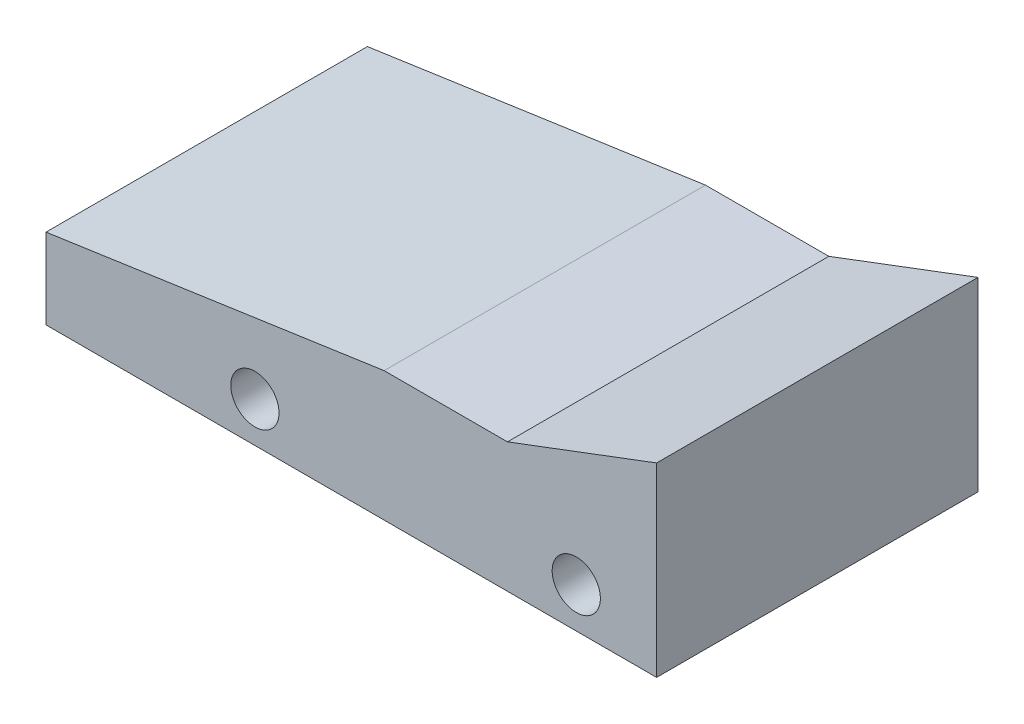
ISO-10303-21;
HEADER;
FILE_DESCRIPTION(('STEP AP214'),'2;1');
FILE_NAME('part.step','',(''),(''),'','','');
FILE_SCHEMA(('AUTOMOTIVE_DESIGN { 1 0 10303 214 1 1 1 1 }'));
ENDSEC;
DATA;
#1=APPLICATION_CONTEXT('core data for automotive mechanical design processes');
#2=APPLICATION_PROTOCOL_DEFINITION('international standard','automotive_design',2000,#1);
#3=PRODUCT_CONTEXT('',#1,'mechanical');
#4=PRODUCT('Part','Part','',(#3));
#5=PRODUCT_RELATED_PRODUCT_CATEGORY('part','',(#4));
#6=PRODUCT_DEFINITION_FORMATION('','',#4);
#7=PRODUCT_DEFINITION_CONTEXT('part definition',#1,'design');
#8=PRODUCT_DEFINITION('design','',#6,#7);
#9=PRODUCT_DEFINITION_SHAPE('','',#8);
#10=(LENGTH_UNIT() NAMED_UNIT(*) SI_UNIT(.MILLI.,.METRE.));
#11=(NAMED_UNIT(*) PLANE_ANGLE_UNIT() SI_UNIT($,.RADIAN.));
#12=(NAMED_UNIT(*) SI_UNIT($,.STERADIAN.) SOLID_ANGLE_UNIT());
#13=UNCERTAINTY_MEASURE_WITH_UNIT(LENGTH_MEASURE(1.E-05),#10,'distance_accuracy_value','');
#14=(GEOMETRIC_REPRESENTATION_CONTEXT(3) GLOBAL_UNCERTAINTY_ASSIGNED_CONTEXT((#13)) GLOBAL_UNIT_ASSIGNED_CONTEXT((#10,
#11,#12)) REPRESENTATION_CONTEXT('',''));
#15=CARTESIAN_POINT('',(0.,0.,0.));
#16=DIRECTION('',(0.,0.,1.));
#17=DIRECTION('',(1.,0.,0.));
#18=AXIS2_PLACEMENT_3D('',#15,#16,#17);
#19=CARTESIAN_POINT('',(0.,0.,508.));
#20=DIRECTION('',(0.,0.,1.));
#21=DIRECTION('',(1.,0.,0.));
#22=AXIS2_PLACEMENT_3D('',#19,#20,#21);
#23=PLANE('',#22);
#24=CARTESIAN_POINT('',(295.731148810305,49.8467537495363,508.));
#25=DIRECTION('',(0.,0.,1.));
#26=DIRECTION('',(1.,0.,0.));
#27=AXIS2_PLACEMENT_3D('',#24,#25,#26);
#28=CIRCLE('',#27,38.1);
#29=CARTESIAN_POINT('',(333.831148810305,49.8467537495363,508.));
#30=VERTEX_POINT('',#29);
#31=EDGE_CURVE('E125',#30,#30,#28,.T.);
#32=ORIENTED_EDGE('',*,*,#31,.F.);
#33=EDGE_LOOP('',(#32));
#34=FACE_BOUND('',#33,.T.);
#35=DIRECTION('',(0.,-1.,0.));
#36=VECTOR('',#35,1.);
#37=CARTESIAN_POINT('',(-34.4688511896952,-13.6532462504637,508.));
#38=LINE('',#37,#36);
#39=CARTESIAN_POINT('',(-34.4688511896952,113.346753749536,508.));
#40=VERTEX_POINT('',#39);
#41=CARTESIAN_POINT('',(-34.4688511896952,-13.6532462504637,508.));
#42=VERTEX_POINT('',#41);
#43=EDGE_CURVE('E132',#40,#42,#38,.T.);
#44=ORIENTED_EDGE('',*,*,#43,.T.);
#45=DIRECTION('',(1.,0.,0.));
#46=VECTOR('',#45,1.);
#47=CARTESIAN_POINT('',(-34.4688511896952,-13.6532462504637,508.));
#48=LINE('',#47,#46);
#49=CARTESIAN_POINT('',(930.731148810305,-13.6532462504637,508.));
#50=VERTEX_POINT('',#49);
#51=EDGE_CURVE('E90',#42,#50,#48,.T.);
#52=ORIENTED_EDGE('',*,*,#51,.T.);
#53=DIRECTION('',(0.,1.,0.));
#54=VECTOR('',#53,1.);
#55=CARTESIAN_POINT('',(930.731148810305,-13.6532462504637,508.));
#56=LINE('',#55,#54);
#57=CARTESIAN_POINT('',(930.731148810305,279.977592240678,508.));
#58=VERTEX_POINT('',#57);
#59=EDGE_CURVE('E103',#50,#58,#56,.T.);
#60=ORIENTED_EDGE('',*,*,#59,.T.);
#61=DIRECTION('',(-0.935522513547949,-0.353267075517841,0.));
#62=VECTOR('',#61,1.);
#63=CARTESIAN_POINT('',(930.731148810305,279.977592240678,508.));
#64=LINE('',#63,#62);
#65=CARTESIAN_POINT('',(694.98905116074,190.957905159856,508.));
#66=VERTEX_POINT('',#65);
#67=EDGE_CURVE('E97',#58,#66,#64,.T.);
#68=ORIENTED_EDGE('',*,*,#67,.T.);
#69=DIRECTION('',(-1.,0.,0.));
#70=VECTOR('',#69,1.);
#71=CARTESIAN_POINT('',(694.98905116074,190.957905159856,508.));
#72=LINE('',#71,#70);
#73=CARTESIAN_POINT('',(499.993546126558,190.957905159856,508.));
#74=VERTEX_POINT('',#73);
#75=EDGE_CURVE('E101',#66,#74,#72,.T.);
#76=ORIENTED_EDGE('',*,*,#75,.T.);
#77=DIRECTION('',(-0.989620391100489,-0.143706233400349,0.));
#78=VECTOR('',#77,1.);
#79=CARTESIAN_POINT('',(499.993546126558,190.957905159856,508.));
#80=LINE('',#79,#78);
#81=EDGE_CURVE('E53',#74,#40,#80,.T.);
#82=ORIENTED_EDGE('',*,*,#81,.T.);
#83=EDGE_LOOP('',(#44,#52,#60,#68,#76,#82));
#84=FACE_BOUND('',#83,.T.);
#85=CARTESIAN_POINT('',(803.731148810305,49.8467537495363,508.));
#86=DIRECTION('',(0.,0.,1.));
#87=DIRECTION('',(1.,0.,0.));
#88=AXIS2_PLACEMENT_3D('',#85,#86,#87);
#89=CIRCLE('',#88,38.1);
#90=CARTESIAN_POINT('',(841.831148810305,49.8467537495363,508.));
#91=VERTEX_POINT('',#90);
#92=EDGE_CURVE('E174',#91,#91,#89,.T.);
#93=ORIENTED_EDGE('',*,*,#92,.F.);
#94=EDGE_LOOP('',(#93));
#95=FACE_BOUND('',#94,.T.);
#96=ADVANCED_FACE('F36',(#34,#84,#95),#23,.T.);
#97=CARTESIAN_POINT('',(0.,0.,0.));
#98=DIRECTION('',(0.,0.,1.));
#99=DIRECTION('',(1.,0.,0.));
#100=AXIS2_PLACEMENT_3D('',#97,#98,#99);
#101=PLANE('',#100);
#102=DIRECTION('',(0.,-1.,0.));
#103=VECTOR('',#102,1.);
#104=CARTESIAN_POINT('',(-34.4688511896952,-13.6532462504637,0.));
#105=LINE('',#104,#103);
#106=CARTESIAN_POINT('',(-34.4688511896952,113.346753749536,0.));
#107=VERTEX_POINT('',#106);
#108=CARTESIAN_POINT('',(-34.4688511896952,-13.6532462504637,0.));
#109=VERTEX_POINT('',#108);
#110=EDGE_CURVE('E121',#107,#109,#105,.T.);
#111=ORIENTED_EDGE('',*,*,#110,.F.);
#112=DIRECTION('',(-0.989620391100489,-0.143706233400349,0.));
#113=VECTOR('',#112,1.);
#114=CARTESIAN_POINT('',(499.993546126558,190.957905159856,0.));
#115=LINE('',#114,#113);
#116=CARTESIAN_POINT('',(499.993546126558,190.957905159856,0.));
#117=VERTEX_POINT('',#116);
#118=EDGE_CURVE('E82',#117,#107,#115,.T.);
#119=ORIENTED_EDGE('',*,*,#118,.F.);
#120=DIRECTION('',(-1.,0.,0.));
#121=VECTOR('',#120,1.);
#122=CARTESIAN_POINT('',(694.98905116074,190.957905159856,0.));
#123=LINE('',#122,#121);
#124=CARTESIAN_POINT('',(694.98905116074,190.957905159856,0.));
#125=VERTEX_POINT('',#124);
#126=EDGE_CURVE('E76',#125,#117,#123,.T.);
#127=ORIENTED_EDGE('',*,*,#126,.F.);
#128=DIRECTION('',(-0.935522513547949,-0.353267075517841,0.));
#129=VECTOR('',#128,1.);
#130=CARTESIAN_POINT('',(930.731148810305,279.977592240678,0.));
#131=LINE('',#130,#129);
#132=CARTESIAN_POINT('',(930.731148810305,279.977592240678,0.));
#133=VERTEX_POINT('',#132);
#134=EDGE_CURVE('E111',#133,#125,#131,.T.);
#135=ORIENTED_EDGE('',*,*,#134,.F.);
#136=DIRECTION('',(0.,1.,0.));
#137=VECTOR('',#136,1.);
#138=CARTESIAN_POINT('',(930.731148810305,-13.6532462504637,0.));
#139=LINE('',#138,#137);
#140=CARTESIAN_POINT('',(930.731148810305,-13.6532462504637,0.));
#141=VERTEX_POINT('',#140);
#142=EDGE_CURVE('E127',#141,#133,#139,.T.);
#143=ORIENTED_EDGE('',*,*,#142,.F.);
#144=DIRECTION('',(1.,0.,0.));
#145=VECTOR('',#144,1.);
#146=CARTESIAN_POINT('',(-34.4688511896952,-13.6532462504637,0.));
#147=LINE('',#146,#145);
#148=EDGE_CURVE('E124',#109,#141,#147,.T.);
#149=ORIENTED_EDGE('',*,*,#148,.F.);
#150=EDGE_LOOP('',(#111,#119,#127,#135,#143,#149));
#151=FACE_BOUND('',#150,.T.);
#152=CARTESIAN_POINT('',(295.731148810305,49.8467537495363,0.));
#153=DIRECTION('',(0.,0.,1.));
#154=DIRECTION('',(1.,0.,0.));
#155=AXIS2_PLACEMENT_3D('',#152,#153,#154);
#156=CIRCLE('',#155,38.1);
#157=CARTESIAN_POINT('',(333.831148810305,49.8467537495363,0.));
#158=VERTEX_POINT('',#157);
#159=EDGE_CURVE('E180',#158,#158,#156,.T.);
#160=ORIENTED_EDGE('',*,*,#159,.T.);
#161=EDGE_LOOP('',(#160));
#162=FACE_BOUND('',#161,.T.);
#163=CARTESIAN_POINT('',(803.731148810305,49.8467537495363,0.));
#164=DIRECTION('',(0.,0.,1.));
#165=DIRECTION('',(1.,0.,0.));
#166=AXIS2_PLACEMENT_3D('',#163,#164,#165);
#167=CIRCLE('',#166,38.1);
#168=CARTESIAN_POINT('',(841.831148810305,49.8467537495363,0.));
#169=VERTEX_POINT('',#168);
#170=EDGE_CURVE('E177',#169,#169,#167,.T.);
#171=ORIENTED_EDGE('',*,*,#170,.T.);
#172=EDGE_LOOP('',(#171));
#173=FACE_BOUND('',#172,.T.);
#174=ADVANCED_FACE('F141',(#151,#162,#173),#101,.F.);
#175=CARTESIAN_POINT('',(-34.4688511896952,-13.6532462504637,508.));
#176=DIRECTION('',(1.,0.,0.));
#177=DIRECTION('',(0.,0.,-1.));
#178=AXIS2_PLACEMENT_3D('',#175,#176,#177);
#179=PLANE('',#178);
#180=ORIENTED_EDGE('',*,*,#110,.T.);
#181=DIRECTION('',(0.,0.,-1.));
#182=VECTOR('',#181,1.);
#183=CARTESIAN_POINT('',(-34.4688511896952,-13.6532462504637,508.));
#184=LINE('',#183,#182);
#185=EDGE_CURVE('E11',#42,#109,#184,.T.);
#186=ORIENTED_EDGE('',*,*,#185,.F.);
#187=ORIENTED_EDGE('',*,*,#43,.F.);
#188=DIRECTION('',(0.,0.,-1.));
#189=VECTOR('',#188,1.);
#190=CARTESIAN_POINT('',(-34.4688511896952,113.346753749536,508.));
#191=LINE('',#190,#189);
#192=EDGE_CURVE('E117',#40,#107,#191,.T.);
#193=ORIENTED_EDGE('',*,*,#192,.T.);
#194=EDGE_LOOP('',(#180,#186,#187,#193));
#195=FACE_BOUND('',#194,.T.);
#196=ADVANCED_FACE('F38',(#195),#179,.F.);
#197=CARTESIAN_POINT('',(-34.4688511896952,-13.6532462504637,508.));
#198=DIRECTION('',(0.,1.,0.));
#199=DIRECTION('',(0.,0.,1.));
#200=AXIS2_PLACEMENT_3D('',#197,#198,#199);
#201=PLANE('',#200);
#202=ORIENTED_EDGE('',*,*,#148,.T.);
#203=DIRECTION('',(0.,0.,-1.));
#204=VECTOR('',#203,1.);
#205=CARTESIAN_POINT('',(930.731148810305,-13.6532462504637,508.));
#206=LINE('',#205,#204);
#207=EDGE_CURVE('E45',#50,#141,#206,.T.);
#208=ORIENTED_EDGE('',*,*,#207,.F.);
#209=ORIENTED_EDGE('',*,*,#51,.F.);
#210=ORIENTED_EDGE('',*,*,#185,.T.);
#211=EDGE_LOOP('',(#202,#208,#209,#210));
#212=FACE_BOUND('',#211,.T.);
#213=ADVANCED_FACE('F221',(#212),#201,.F.);
#214=CARTESIAN_POINT('',(930.731148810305,-13.6532462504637,508.));
#215=DIRECTION('',(-1.,0.,0.));
#216=DIRECTION('',(0.,0.,1.));
#217=AXIS2_PLACEMENT_3D('',#214,#215,#216);
#218=PLANE('',#217);
#219=ORIENTED_EDGE('',*,*,#142,.T.);
#220=DIRECTION('',(0.,0.,-1.));
#221=VECTOR('',#220,1.);
#222=CARTESIAN_POINT('',(930.731148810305,279.977592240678,508.));
#223=LINE('',#222,#221);
#224=EDGE_CURVE('E112',#58,#133,#223,.T.);
#225=ORIENTED_EDGE('',*,*,#224,.F.);
#226=ORIENTED_EDGE('',*,*,#59,.F.);
#227=ORIENTED_EDGE('',*,*,#207,.T.);
#228=EDGE_LOOP('',(#219,#225,#226,#227));
#229=FACE_BOUND('',#228,.T.);
#230=ADVANCED_FACE('F138',(#229),#218,.F.);
#231=CARTESIAN_POINT('',(930.731148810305,279.977592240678,508.));
#232=DIRECTION('',(0.353267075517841,-0.935522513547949,0.));
#233=DIRECTION('',(0.935522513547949,0.353267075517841,0.));
#234=AXIS2_PLACEMENT_3D('',#231,#232,#233);
#235=PLANE('',#234);
#236=ORIENTED_EDGE('',*,*,#134,.T.);
#237=DIRECTION('',(0.,0.,-1.));
#238=VECTOR('',#237,1.);
#239=CARTESIAN_POINT('',(694.98905116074,190.957905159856,508.));
#240=LINE('',#239,#238);
#241=EDGE_CURVE('E108',#66,#125,#240,.T.);
#242=ORIENTED_EDGE('',*,*,#241,.F.);
#243=ORIENTED_EDGE('',*,*,#67,.F.);
#244=ORIENTED_EDGE('',*,*,#224,.T.);
#245=EDGE_LOOP('',(#236,#242,#243,#244));
#246=FACE_BOUND('',#245,.T.);
#247=ADVANCED_FACE('F109',(#246),#235,.F.);
#248=CARTESIAN_POINT('',(694.98905116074,190.957905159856,508.));
#249=DIRECTION('',(0.,-1.,0.));
#250=DIRECTION('',(0.,0.,-1.));
#251=AXIS2_PLACEMENT_3D('',#248,#249,#250);
#252=PLANE('',#251);
#253=ORIENTED_EDGE('',*,*,#126,.T.);
#254=DIRECTION('',(0.,0.,-1.));
#255=VECTOR('',#254,1.);
#256=CARTESIAN_POINT('',(499.993546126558,190.957905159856,508.));
#257=LINE('',#256,#255);
#258=EDGE_CURVE('E113',#74,#117,#257,.T.);
#259=ORIENTED_EDGE('',*,*,#258,.F.);
#260=ORIENTED_EDGE('',*,*,#75,.F.);
#261=ORIENTED_EDGE('',*,*,#241,.T.);
#262=EDGE_LOOP('',(#253,#259,#260,#261));
#263=FACE_BOUND('',#262,.T.);
#264=ADVANCED_FACE('F115',(#263),#252,.F.);
#265=CARTESIAN_POINT('',(499.993546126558,190.957905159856,508.));
#266=DIRECTION('',(0.143706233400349,-0.989620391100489,0.));
#267=DIRECTION('',(0.989620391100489,0.143706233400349,0.));
#268=AXIS2_PLACEMENT_3D('',#265,#266,#267);
#269=PLANE('',#268);
#270=ORIENTED_EDGE('',*,*,#118,.T.);
#271=ORIENTED_EDGE('',*,*,#192,.F.);
#272=ORIENTED_EDGE('',*,*,#81,.F.);
#273=ORIENTED_EDGE('',*,*,#258,.T.);
#274=EDGE_LOOP('',(#270,#271,#272,#273));
#275=FACE_BOUND('',#274,.T.);
#276=ADVANCED_FACE('F146',(#275),#269,.F.);
#277=CARTESIAN_POINT('',(295.731148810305,49.8467537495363,508.));
#278=DIRECTION('',(0.,0.,-1.));
#279=DIRECTION('',(-1.,0.,0.));
#280=AXIS2_PLACEMENT_3D('',#277,#278,#279);
#281=CYLINDRICAL_SURFACE('',#280,38.1);
#282=ORIENTED_EDGE('',*,*,#31,.T.);
#283=EDGE_LOOP('',(#282));
#284=FACE_BOUND('',#283,.T.);
#285=ORIENTED_EDGE('',*,*,#159,.F.);
#286=EDGE_LOOP('',(#285));
#287=FACE_BOUND('',#286,.T.);
#288=ADVANCED_FACE('F148',(#284,#287),#281,.F.);
#289=CARTESIAN_POINT('',(803.731148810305,49.8467537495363,508.));
#290=DIRECTION('',(0.,0.,-1.));
#291=DIRECTION('',(-1.,0.,0.));
#292=AXIS2_PLACEMENT_3D('',#289,#290,#291);
#293=CYLINDRICAL_SURFACE('',#292,38.1);
#294=ORIENTED_EDGE('',*,*,#92,.T.);
#295=EDGE_LOOP('',(#294));
#296=FACE_BOUND('',#295,.T.);
#297=ORIENTED_EDGE('',*,*,#170,.F.);
#298=EDGE_LOOP('',(#297));
#299=FACE_BOUND('',#298,.T.);
#300=ADVANCED_FACE('F154',(#296,#299),#293,.F.);
#301=CLOSED_SHELL('',(#96,#174,#196,#213,#230,#247,#264,#276,#288,#300));
#302=MANIFOLD_SOLID_BREP('B2',#301);
#303=ADVANCED_BREP_SHAPE_REPRESENTATION('',(#18,#302),#14);
#304=SHAPE_DEFINITION_REPRESENTATION(#9,#303);
ENDSEC;
END-ISO-10303-21;
